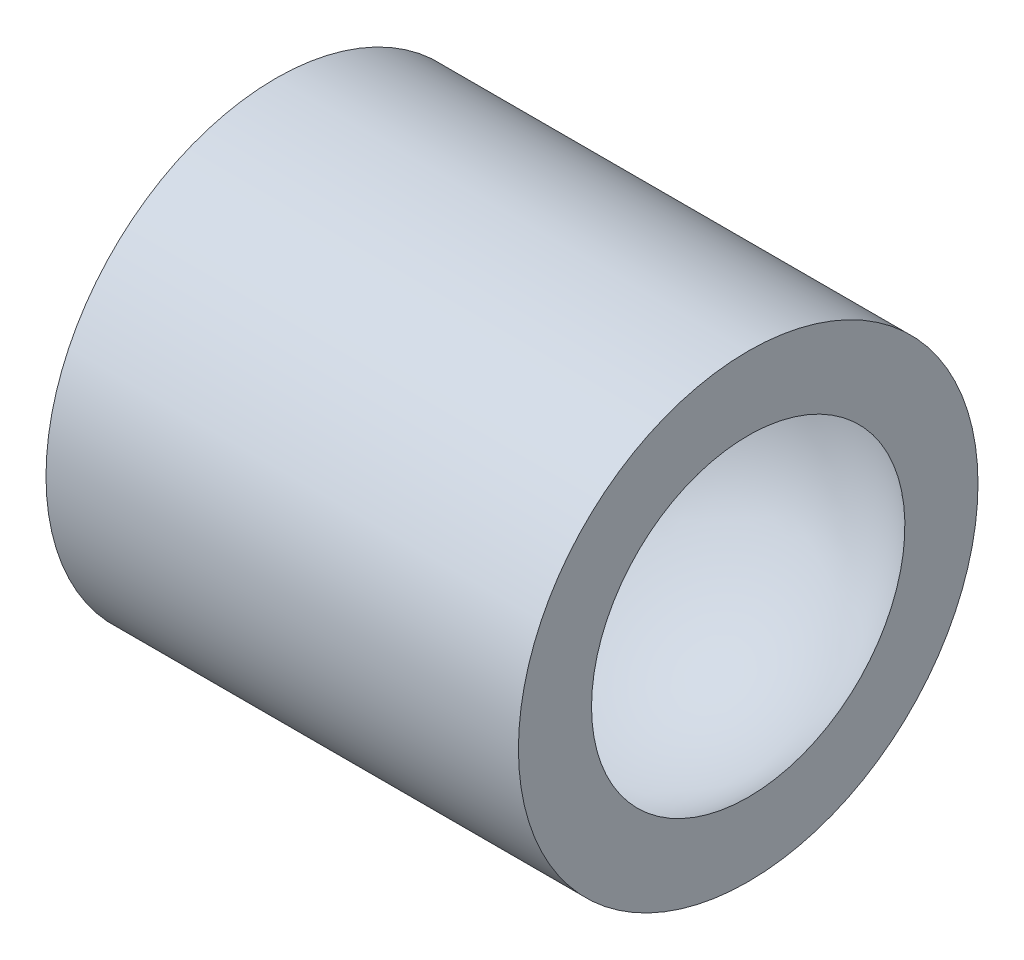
from build123d import *


with BuildPart() as part:
    # Skizze1 → Rotation1 (revolve)
    with BuildSketch(Plane.XY, mode=Mode.PRIVATE) as rotation1_sk:
        with BuildLine():
            Line((33.071891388, 37.5), (33.071891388, 55))
            Line((33.071891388, 55), (-80, 55))
            Line((-80, 55), (-80, 0))
            Line((-80, 0), (-50, 0))
            ThreePointArc((-50, 0), (-20.571891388, 45.571891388), (33.071891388, 37.5))
        make_face()
    revolve(rotation1_sk.sketch.rotate(Axis((0, 0, 0), (1, 0, 0)), 180), axis=Axis((0, 0, 0), (1, 0, 0)))


solid = part.part
